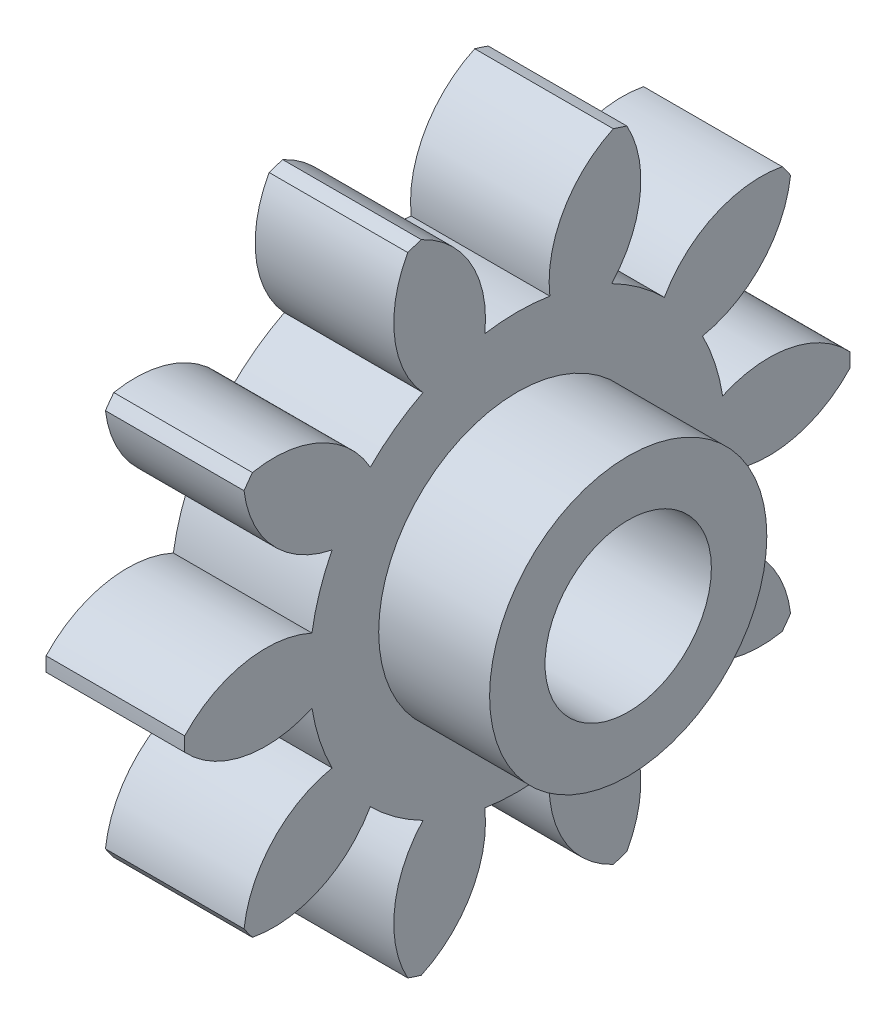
ISO-10303-21;
HEADER;
FILE_DESCRIPTION(('STEP AP214'),'2;1');
FILE_NAME('part.step','',(''),(''),'','','');
FILE_SCHEMA(('AUTOMOTIVE_DESIGN { 1 0 10303 214 1 1 1 1 }'));
ENDSEC;
DATA;
#1=APPLICATION_CONTEXT('core data for automotive mechanical design processes');
#2=APPLICATION_PROTOCOL_DEFINITION('international standard','automotive_design',2000,#1);
#3=PRODUCT_CONTEXT('',#1,'mechanical');
#4=PRODUCT('Part','Part','',(#3));
#5=PRODUCT_RELATED_PRODUCT_CATEGORY('part','',(#4));
#6=PRODUCT_DEFINITION_FORMATION('','',#4);
#7=PRODUCT_DEFINITION_CONTEXT('part definition',#1,'design');
#8=PRODUCT_DEFINITION('design','',#6,#7);
#9=PRODUCT_DEFINITION_SHAPE('','',#8);
#10=(LENGTH_UNIT() NAMED_UNIT(*) SI_UNIT(.MILLI.,.METRE.));
#11=(NAMED_UNIT(*) PLANE_ANGLE_UNIT() SI_UNIT($,.RADIAN.));
#12=(NAMED_UNIT(*) SI_UNIT($,.STERADIAN.) SOLID_ANGLE_UNIT());
#13=UNCERTAINTY_MEASURE_WITH_UNIT(LENGTH_MEASURE(1.E-05),#10,'distance_accuracy_value','');
#14=(GEOMETRIC_REPRESENTATION_CONTEXT(3) GLOBAL_UNCERTAINTY_ASSIGNED_CONTEXT((#13)) GLOBAL_UNIT_ASSIGNED_CONTEXT((#10,
#11,#12)) REPRESENTATION_CONTEXT('',''));
#15=CARTESIAN_POINT('',(0.,0.,0.));
#16=DIRECTION('',(0.,0.,1.));
#17=DIRECTION('',(1.,0.,0.));
#18=AXIS2_PLACEMENT_3D('',#15,#16,#17);
#19=CARTESIAN_POINT('',(5.,0.,0.));
#20=DIRECTION('',(-1.,0.,0.));
#21=DIRECTION('',(0.,0.,1.));
#22=AXIS2_PLACEMENT_3D('',#19,#20,#21);
#23=PLANE('',#22);
#24=CARTESIAN_POINT('',(5.,3.3343462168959,-8.78546284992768));
#25=DIRECTION('',(-1.,0.,0.));
#26=DIRECTION('',(0.,-0.587785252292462,-0.809016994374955));
#27=AXIS2_PLACEMENT_3D('',#24,#25,#26);
#28=CIRCLE('',#27,4.);
#29=CARTESIAN_POINT('',(5.,5.30219236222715,-5.30299511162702));
#30=VERTEX_POINT('',#29);
#31=CARTESIAN_POINT('',(5.,7.25962702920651,-9.55498903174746));
#32=VERTEX_POINT('',#31);
#33=EDGE_CURVE('E301',#30,#32,#28,.T.);
#34=ORIENTED_EDGE('',*,*,#33,.F.);
#35=CARTESIAN_POINT('',(5.,0.,0.));
#36=DIRECTION('',(-1.,0.,0.));
#37=DIRECTION('',(0.,-0.587785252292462,-0.809016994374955));
#38=AXIS2_PLACEMENT_3D('',#35,#36,#37);
#39=CIRCLE('',#38,7.499);
#40=CARTESIAN_POINT('',(5.,6.68191560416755,-3.40396898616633));
#41=VERTEX_POINT('',#40);
#42=EDGE_CURVE('E300',#41,#30,#39,.T.);
#43=ORIENTED_EDGE('',*,*,#42,.F.);
#44=CARTESIAN_POINT('',(5.,9.38584133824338,-0.456294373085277));
#45=DIRECTION('',(-1.,0.,0.));
#46=DIRECTION('',(0.,-0.587785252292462,-0.809016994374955));
#47=AXIS2_PLACEMENT_3D('',#44,#45,#46);
#48=CIRCLE('',#47,4.);
#49=CARTESIAN_POINT('',(5.,11.3306827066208,-3.9516616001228));
#50=VERTEX_POINT('',#49);
#51=EDGE_CURVE('E289',#50,#41,#48,.T.);
#52=ORIENTED_EDGE('',*,*,#51,.F.);
#53=CARTESIAN_POINT('',(5.,0.,0.));
#54=DIRECTION('',(-1.,0.,0.));
#55=DIRECTION('',(0.,0.,1.));
#56=AXIS2_PLACEMENT_3D('',#53,#54,#55);
#57=CIRCLE('',#56,12.);
#58=CARTESIAN_POINT('',(5.,11.4894432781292,-3.46304680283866));
#59=VERTEX_POINT('',#58);
#60=EDGE_CURVE('E524',#59,#50,#57,.T.);
#61=ORIENTED_EDGE('',*,*,#60,.F.);
#62=CARTESIAN_POINT('',(5.,7.86150825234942,-5.14770921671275));
#63=DIRECTION('',(-1.,0.,0.));
#64=DIRECTION('',(0.,0.,-1.));
#65=AXIS2_PLACEMENT_3D('',#62,#63,#64);
#66=CIRCLE('',#65,4.);
#67=CARTESIAN_POINT('',(5.,7.40658604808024,-1.17366269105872));
#68=VERTEX_POINT('',#67);
#69=EDGE_CURVE('E497',#68,#59,#66,.T.);
#70=ORIENTED_EDGE('',*,*,#69,.F.);
#71=CARTESIAN_POINT('',(5.,0.,0.));
#72=DIRECTION('',(-1.,0.,0.));
#73=DIRECTION('',(0.,0.,-1.));
#74=AXIS2_PLACEMENT_3D('',#71,#72,#73);
#75=CIRCLE('',#74,7.499);
#76=CARTESIAN_POINT('',(5.,7.40658604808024,1.17366269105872));
#77=VERTEX_POINT('',#76);
#78=EDGE_CURVE('E502',#77,#68,#75,.T.);
#79=ORIENTED_EDGE('',*,*,#78,.F.);
#80=CARTESIAN_POINT('',(5.,7.86150825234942,5.14770921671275));
#81=DIRECTION('',(-1.,0.,0.));
#82=DIRECTION('',(0.,0.,-1.));
#83=AXIS2_PLACEMENT_3D('',#80,#81,#82);
#84=CIRCLE('',#83,4.);
#85=CARTESIAN_POINT('',(5.,11.4894432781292,3.46304680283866));
#86=VERTEX_POINT('',#85);
#87=EDGE_CURVE('E499',#86,#77,#84,.T.);
#88=ORIENTED_EDGE('',*,*,#87,.F.);
#89=CARTESIAN_POINT('',(5.,11.3306827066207,3.95166160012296));
#90=VERTEX_POINT('',#89);
#91=EDGE_CURVE('E522',#90,#86,#57,.T.);
#92=ORIENTED_EDGE('',*,*,#91,.F.);
#93=CARTESIAN_POINT('',(5.,9.38584133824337,0.456294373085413));
#94=DIRECTION('',(-1.,0.,0.));
#95=DIRECTION('',(0.,0.587785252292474,-0.809016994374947));
#96=AXIS2_PLACEMENT_3D('',#93,#94,#95);
#97=CIRCLE('',#96,4.);
#98=CARTESIAN_POINT('',(5.,6.6819156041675,3.40396898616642));
#99=VERTEX_POINT('',#98);
#100=EDGE_CURVE('E475',#99,#90,#97,.T.);
#101=ORIENTED_EDGE('',*,*,#100,.F.);
#102=CARTESIAN_POINT('',(5.,0.,0.));
#103=DIRECTION('',(-1.,0.,0.));
#104=DIRECTION('',(0.,0.587785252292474,-0.809016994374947));
#105=AXIS2_PLACEMENT_3D('',#102,#103,#104);
#106=CIRCLE('',#105,7.499);
#107=CARTESIAN_POINT('',(5.,5.30219236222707,5.3029951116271));
#108=VERTEX_POINT('',#107);
#109=EDGE_CURVE('E480',#108,#99,#106,.T.);
#110=ORIENTED_EDGE('',*,*,#109,.F.);
#111=CARTESIAN_POINT('',(5.,3.33434621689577,8.78546284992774));
#112=DIRECTION('',(-1.,0.,0.));
#113=DIRECTION('',(0.,0.587785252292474,-0.809016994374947));
#114=AXIS2_PLACEMENT_3D('',#111,#112,#113);
#115=CIRCLE('',#114,4.);
#116=CARTESIAN_POINT('',(5.,7.25962702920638,9.55498903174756));
#117=VERTEX_POINT('',#116);
#118=EDGE_CURVE('E477',#117,#108,#115,.T.);
#119=ORIENTED_EDGE('',*,*,#118,.F.);
#120=CARTESIAN_POINT('',(5.,6.84398645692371,9.8569695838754));
#121=VERTEX_POINT('',#120);
#122=EDGE_CURVE('E599',#121,#117,#57,.T.);
#123=ORIENTED_EDGE('',*,*,#122,.F.);
#124=CARTESIAN_POINT('',(5.,7.32510204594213,5.88600902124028));
#125=DIRECTION('',(-1.,0.,0.));
#126=DIRECTION('',(0.,0.951056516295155,-0.309016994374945));
#127=AXIS2_PLACEMENT_3D('',#124,#125,#126);
#128=CIRCLE('',#127,4.);
#129=CARTESIAN_POINT('',(5.,3.40498050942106,6.68140020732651));
#130=VERTEX_POINT('',#129);
#131=EDGE_CURVE('E453',#130,#121,#128,.T.);
#132=ORIENTED_EDGE('',*,*,#131,.F.);
#133=CARTESIAN_POINT('',(5.,0.,0.));
#134=DIRECTION('',(-1.,0.,0.));
#135=DIRECTION('',(0.,0.951056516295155,-0.309016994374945));
#136=AXIS2_PLACEMENT_3D('',#133,#134,#135);
#137=CIRCLE('',#136,7.499);
#138=CARTESIAN_POINT('',(5.,1.17254140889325,7.40676364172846));
#139=VERTEX_POINT('',#138);
#140=EDGE_CURVE('E458',#139,#130,#137,.T.);
#141=ORIENTED_EDGE('',*,*,#140,.F.);
#142=CARTESIAN_POINT('',(5.,-2.46642274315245,9.06746828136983));
#143=DIRECTION('',(-1.,0.,0.));
#144=DIRECTION('',(0.,0.951056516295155,-0.309016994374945));
#145=AXIS2_PLACEMENT_3D('',#142,#143,#144);
#146=CIRCLE('',#145,4.);
#147=CARTESIAN_POINT('',(5.,0.256880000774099,11.9972502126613));
#148=VERTEX_POINT('',#147);
#149=EDGE_CURVE('E455',#148,#139,#146,.T.);
#150=ORIENTED_EDGE('',*,*,#149,.F.);
#151=CARTESIAN_POINT('',(5.,-0.256880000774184,11.9972502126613));
#152=VERTEX_POINT('',#151);
#153=EDGE_CURVE('E594',#152,#148,#57,.T.);
#154=ORIENTED_EDGE('',*,*,#153,.F.);
#155=CARTESIAN_POINT('',(5.,2.46642274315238,9.06746828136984));
#156=DIRECTION('',(-1.,0.,0.));
#157=DIRECTION('',(0.,0.951056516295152,0.309016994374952));
#158=AXIS2_PLACEMENT_3D('',#155,#156,#157);
#159=CIRCLE('',#158,4.);
#160=CARTESIAN_POINT('',(5.,-1.17254140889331,7.40676364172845));
#161=VERTEX_POINT('',#160);
#162=EDGE_CURVE('E431',#161,#152,#159,.T.);
#163=ORIENTED_EDGE('',*,*,#162,.F.);
#164=CARTESIAN_POINT('',(5.,0.,0.));
#165=DIRECTION('',(-1.,0.,0.));
#166=DIRECTION('',(0.,0.951056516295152,0.309016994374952));
#167=AXIS2_PLACEMENT_3D('',#164,#165,#166);
#168=CIRCLE('',#167,7.499);
#169=CARTESIAN_POINT('',(5.,-3.40498050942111,6.68140020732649));
#170=VERTEX_POINT('',#169);
#171=EDGE_CURVE('E436',#170,#161,#168,.T.);
#172=ORIENTED_EDGE('',*,*,#171,.F.);
#173=CARTESIAN_POINT('',(5.,-7.32510204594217,5.88600902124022));
#174=DIRECTION('',(-1.,0.,0.));
#175=DIRECTION('',(0.,0.951056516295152,0.309016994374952));
#176=AXIS2_PLACEMENT_3D('',#173,#174,#175);
#177=CIRCLE('',#176,4.);
#178=CARTESIAN_POINT('',(5.,-6.84398645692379,9.85696958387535));
#179=VERTEX_POINT('',#178);
#180=EDGE_CURVE('E433',#179,#170,#177,.T.);
#181=ORIENTED_EDGE('',*,*,#180,.F.);
#182=CARTESIAN_POINT('',(5.,-7.25962702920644,9.55498903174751));
#183=VERTEX_POINT('',#182);
#184=EDGE_CURVE('E589',#183,#179,#57,.T.);
#185=ORIENTED_EDGE('',*,*,#184,.F.);
#186=CARTESIAN_POINT('',(5.,-3.33434621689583,8.78546284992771));
#187=DIRECTION('',(-1.,0.,0.));
#188=DIRECTION('',(0.,0.587785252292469,0.809016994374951));
#189=AXIS2_PLACEMENT_3D('',#186,#187,#188);
#190=CIRCLE('',#189,4.);
#191=CARTESIAN_POINT('',(5.,-5.30219236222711,5.30299511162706));
#192=VERTEX_POINT('',#191);
#193=EDGE_CURVE('E409',#192,#183,#190,.T.);
#194=ORIENTED_EDGE('',*,*,#193,.F.);
#195=CARTESIAN_POINT('',(5.,0.,0.));
#196=DIRECTION('',(-1.,0.,0.));
#197=DIRECTION('',(0.,0.587785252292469,0.809016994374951));
#198=AXIS2_PLACEMENT_3D('',#195,#196,#197);
#199=CIRCLE('',#198,7.499);
#200=CARTESIAN_POINT('',(5.,-6.68191560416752,3.40396898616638));
#201=VERTEX_POINT('',#200);
#202=EDGE_CURVE('E414',#201,#192,#199,.T.);
#203=ORIENTED_EDGE('',*,*,#202,.F.);
#204=CARTESIAN_POINT('',(5.,-9.38584133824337,0.456294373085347));
#205=DIRECTION('',(-1.,0.,0.));
#206=DIRECTION('',(0.,0.587785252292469,0.809016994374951));
#207=AXIS2_PLACEMENT_3D('',#204,#205,#206);
#208=CIRCLE('',#207,4.);
#209=CARTESIAN_POINT('',(5.,-11.3306827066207,3.95166160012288));
#210=VERTEX_POINT('',#209);
#211=EDGE_CURVE('E411',#210,#201,#208,.T.);
#212=ORIENTED_EDGE('',*,*,#211,.F.);
#213=CARTESIAN_POINT('',(5.,-11.4894432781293,3.46304680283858));
#214=VERTEX_POINT('',#213);
#215=EDGE_CURVE('E584',#214,#210,#57,.T.);
#216=ORIENTED_EDGE('',*,*,#215,.F.);
#217=CARTESIAN_POINT('',(5.,-7.86150825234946,5.1477092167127));
#218=DIRECTION('',(-1.,0.,0.));
#219=DIRECTION('',(0.,0.,1.));
#220=AXIS2_PLACEMENT_3D('',#217,#218,#219);
#221=CIRCLE('',#220,4.);
#222=CARTESIAN_POINT('',(5.,-7.40658604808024,1.17366269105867));
#223=VERTEX_POINT('',#222);
#224=EDGE_CURVE('E387',#223,#214,#221,.T.);
#225=ORIENTED_EDGE('',*,*,#224,.F.);
#226=CARTESIAN_POINT('',(5.,0.,0.));
#227=DIRECTION('',(-1.,0.,0.));
#228=DIRECTION('',(0.,0.,1.));
#229=AXIS2_PLACEMENT_3D('',#226,#227,#228);
#230=CIRCLE('',#229,7.499);
#231=CARTESIAN_POINT('',(5.,-7.40658604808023,-1.17366269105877));
#232=VERTEX_POINT('',#231);
#233=EDGE_CURVE('E392',#232,#223,#230,.T.);
#234=ORIENTED_EDGE('',*,*,#233,.F.);
#235=CARTESIAN_POINT('',(5.,-7.86150825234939,-5.14770921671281));
#236=DIRECTION('',(-1.,0.,0.));
#237=DIRECTION('',(0.,0.,1.));
#238=AXIS2_PLACEMENT_3D('',#235,#236,#237);
#239=CIRCLE('',#238,4.);
#240=CARTESIAN_POINT('',(5.,-11.4894432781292,-3.46304680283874));
#241=VERTEX_POINT('',#240);
#242=EDGE_CURVE('E389',#241,#232,#239,.T.);
#243=ORIENTED_EDGE('',*,*,#242,.F.);
#244=CARTESIAN_POINT('',(5.,-11.3306827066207,-3.95166160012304));
#245=VERTEX_POINT('',#244);
#246=EDGE_CURVE('E579',#245,#241,#57,.T.);
#247=ORIENTED_EDGE('',*,*,#246,.F.);
#248=CARTESIAN_POINT('',(5.,-9.38584133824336,-0.456294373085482));
#249=DIRECTION('',(-1.,0.,0.));
#250=DIRECTION('',(0.,-0.58778525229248,0.809016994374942));
#251=AXIS2_PLACEMENT_3D('',#248,#249,#250);
#252=CIRCLE('',#251,4.);
#253=CARTESIAN_POINT('',(5.,-6.68191560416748,-3.40396898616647));
#254=VERTEX_POINT('',#253);
#255=EDGE_CURVE('E365',#254,#245,#252,.T.);
#256=ORIENTED_EDGE('',*,*,#255,.F.);
#257=CARTESIAN_POINT('',(5.,0.,0.));
#258=DIRECTION('',(-1.,0.,0.));
#259=DIRECTION('',(0.,-0.58778525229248,0.809016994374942));
#260=AXIS2_PLACEMENT_3D('',#257,#258,#259);
#261=CIRCLE('',#260,7.499);
#262=CARTESIAN_POINT('',(5.,-5.30219236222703,-5.30299511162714));
#263=VERTEX_POINT('',#262);
#264=EDGE_CURVE('E370',#263,#254,#261,.T.);
#265=ORIENTED_EDGE('',*,*,#264,.F.);
#266=CARTESIAN_POINT('',(5.,-3.3343462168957,-8.78546284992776));
#267=DIRECTION('',(-1.,0.,0.));
#268=DIRECTION('',(0.,-0.58778525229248,0.809016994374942));
#269=AXIS2_PLACEMENT_3D('',#266,#267,#268);
#270=CIRCLE('',#269,4.);
#271=CARTESIAN_POINT('',(5.,-7.2596270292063,-9.55498903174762));
#272=VERTEX_POINT('',#271);
#273=EDGE_CURVE('E367',#272,#263,#270,.T.);
#274=ORIENTED_EDGE('',*,*,#273,.F.);
#275=CARTESIAN_POINT('',(5.,-6.84398645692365,-9.85696958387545));
#276=VERTEX_POINT('',#275);
#277=EDGE_CURVE('E574',#276,#272,#57,.T.);
#278=ORIENTED_EDGE('',*,*,#277,.F.);
#279=CARTESIAN_POINT('',(5.,-7.32510204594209,-5.88600902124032));
#280=DIRECTION('',(-1.,0.,0.));
#281=DIRECTION('',(0.,-0.951056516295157,0.309016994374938));
#282=AXIS2_PLACEMENT_3D('',#279,#280,#281);
#283=CIRCLE('',#282,4.);
#284=CARTESIAN_POINT('',(5.,-3.40498050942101,-6.68140020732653));
#285=VERTEX_POINT('',#284);
#286=EDGE_CURVE('E343',#285,#276,#283,.T.);
#287=ORIENTED_EDGE('',*,*,#286,.F.);
#288=CARTESIAN_POINT('',(5.,0.,0.));
#289=DIRECTION('',(-1.,0.,0.));
#290=DIRECTION('',(0.,-0.951056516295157,0.309016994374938));
#291=AXIS2_PLACEMENT_3D('',#288,#289,#290);
#292=CIRCLE('',#291,7.499);
#293=CARTESIAN_POINT('',(5.,-1.1725414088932,-7.40676364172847));
#294=VERTEX_POINT('',#293);
#295=EDGE_CURVE('E348',#294,#285,#292,.T.);
#296=ORIENTED_EDGE('',*,*,#295,.F.);
#297=CARTESIAN_POINT('',(5.,2.46642274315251,-9.06746828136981));
#298=DIRECTION('',(-1.,0.,0.));
#299=DIRECTION('',(0.,-0.951056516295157,0.309016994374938));
#300=AXIS2_PLACEMENT_3D('',#297,#298,#299);
#301=CIRCLE('',#300,4.);
#302=CARTESIAN_POINT('',(5.,-0.256880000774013,-11.9972502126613));
#303=VERTEX_POINT('',#302);
#304=EDGE_CURVE('E345',#303,#294,#301,.T.);
#305=ORIENTED_EDGE('',*,*,#304,.F.);
#306=CARTESIAN_POINT('',(5.,0.256880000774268,-11.9972502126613));
#307=VERTEX_POINT('',#306);
#308=EDGE_CURVE('E573',#307,#303,#57,.T.);
#309=ORIENTED_EDGE('',*,*,#308,.F.);
#310=CARTESIAN_POINT('',(5.,-2.46642274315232,-9.06746828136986));
#311=DIRECTION('',(-1.,0.,0.));
#312=DIRECTION('',(0.,-0.95105651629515,-0.309016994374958));
#313=AXIS2_PLACEMENT_3D('',#310,#311,#312);
#314=CIRCLE('',#313,4.);
#315=CARTESIAN_POINT('',(5.,1.17254140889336,-7.40676364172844));
#316=VERTEX_POINT('',#315);
#317=EDGE_CURVE('E323',#316,#307,#314,.T.);
#318=ORIENTED_EDGE('',*,*,#317,.F.);
#319=CARTESIAN_POINT('',(5.,0.,0.));
#320=DIRECTION('',(-1.,0.,0.));
#321=DIRECTION('',(0.,-0.95105651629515,-0.309016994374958));
#322=AXIS2_PLACEMENT_3D('',#319,#320,#321);
#323=CIRCLE('',#322,7.499);
#324=CARTESIAN_POINT('',(5.,3.40498050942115,-6.68140020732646));
#325=VERTEX_POINT('',#324);
#326=EDGE_CURVE('E328',#325,#316,#323,.T.);
#327=ORIENTED_EDGE('',*,*,#326,.F.);
#328=CARTESIAN_POINT('',(5.,7.32510204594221,-5.88600902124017));
#329=DIRECTION('',(-1.,0.,0.));
#330=DIRECTION('',(0.,-0.95105651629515,-0.309016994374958));
#331=AXIS2_PLACEMENT_3D('',#328,#329,#330);
#332=CIRCLE('',#331,4.);
#333=CARTESIAN_POINT('',(5.,6.84398645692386,-9.8569695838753));
#334=VERTEX_POINT('',#333);
#335=EDGE_CURVE('E325',#334,#325,#332,.T.);
#336=ORIENTED_EDGE('',*,*,#335,.F.);
#337=EDGE_CURVE('E527',#32,#334,#57,.T.);
#338=ORIENTED_EDGE('',*,*,#337,.F.);
#339=EDGE_LOOP('',(#34,#43,#52,#61,#70,#79,#88,#92,#101,#110,#119,#123,#132,#141,#150,#154,#163,
#172,#181,#185,#194,#203,#212,#216,#225,#234,#243,#247,#256,#265,#274,#278,#287,#296,#305,#309,
#318,#327,#336,#338));
#340=FACE_BOUND('',#339,.T.);
#341=CARTESIAN_POINT('',(5.,0.,0.));
#342=DIRECTION('',(-1.,0.,0.));
#343=DIRECTION('',(0.,0.,1.));
#344=AXIS2_PLACEMENT_3D('',#341,#342,#343);
#345=CIRCLE('',#344,5.);
#346=CARTESIAN_POINT('',(5.,0.,5.));
#347=VERTEX_POINT('',#346);
#348=EDGE_CURVE('E11',#347,#347,#345,.F.);
#349=ORIENTED_EDGE('',*,*,#348,.F.);
#350=EDGE_LOOP('',(#349));
#351=FACE_BOUND('',#350,.T.);
#352=ADVANCED_FACE('F32',(#340,#351),#23,.F.);
#353=CARTESIAN_POINT('',(0.,0.,0.));
#354=DIRECTION('',(1.,0.,0.));
#355=DIRECTION('',(0.,0.,-1.));
#356=AXIS2_PLACEMENT_3D('',#353,#354,#355);
#357=PLANE('',#356);
#358=CARTESIAN_POINT('',(0.,3.3343462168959,-8.78546284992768));
#359=DIRECTION('',(-1.,0.,0.));
#360=DIRECTION('',(0.,-0.587785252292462,-0.809016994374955));
#361=AXIS2_PLACEMENT_3D('',#358,#359,#360);
#362=CIRCLE('',#361,4.);
#363=CARTESIAN_POINT('',(0.,5.30219236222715,-5.30299511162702));
#364=VERTEX_POINT('',#363);
#365=CARTESIAN_POINT('',(0.,7.25962702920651,-9.55498903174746));
#366=VERTEX_POINT('',#365);
#367=EDGE_CURVE('E46',#364,#366,#362,.T.);
#368=ORIENTED_EDGE('',*,*,#367,.T.);
#369=CARTESIAN_POINT('',(0.,0.,0.));
#370=DIRECTION('',(-1.,0.,0.));
#371=DIRECTION('',(0.,0.,1.));
#372=AXIS2_PLACEMENT_3D('',#369,#370,#371);
#373=CIRCLE('',#372,12.);
#374=CARTESIAN_POINT('',(0.,6.84398645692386,-9.8569695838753));
#375=VERTEX_POINT('',#374);
#376=EDGE_CURVE('E523',#366,#375,#373,.T.);
#377=ORIENTED_EDGE('',*,*,#376,.T.);
#378=CARTESIAN_POINT('',(0.,7.32510204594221,-5.88600902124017));
#379=DIRECTION('',(1.,0.,0.));
#380=DIRECTION('',(0.,0.,-1.));
#381=AXIS2_PLACEMENT_3D('',#378,#379,#380);
#382=CIRCLE('',#381,4.);
#383=CARTESIAN_POINT('',(0.,3.40498050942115,-6.68140020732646));
#384=VERTEX_POINT('',#383);
#385=EDGE_CURVE('E551',#384,#375,#382,.T.);
#386=ORIENTED_EDGE('',*,*,#385,.F.);
#387=CARTESIAN_POINT('',(0.,0.,0.));
#388=DIRECTION('',(-1.,0.,0.));
#389=DIRECTION('',(0.,-0.95105651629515,-0.309016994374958));
#390=AXIS2_PLACEMENT_3D('',#387,#388,#389);
#391=CIRCLE('',#390,7.499);
#392=CARTESIAN_POINT('',(0.,1.17254140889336,-7.40676364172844));
#393=VERTEX_POINT('',#392);
#394=EDGE_CURVE('E326',#384,#393,#391,.T.);
#395=ORIENTED_EDGE('',*,*,#394,.T.);
#396=CARTESIAN_POINT('',(0.,-2.46642274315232,-9.06746828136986));
#397=DIRECTION('',(-1.,0.,0.));
#398=DIRECTION('',(0.,-0.95105651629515,-0.309016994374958));
#399=AXIS2_PLACEMENT_3D('',#396,#397,#398);
#400=CIRCLE('',#399,4.);
#401=CARTESIAN_POINT('',(0.,0.256880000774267,-11.9972502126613));
#402=VERTEX_POINT('',#401);
#403=EDGE_CURVE('E54',#393,#402,#400,.T.);
#404=ORIENTED_EDGE('',*,*,#403,.T.);
#405=CARTESIAN_POINT('',(0.,-0.256880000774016,-11.9972502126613));
#406=VERTEX_POINT('',#405);
#407=EDGE_CURVE('E1059',#402,#406,#373,.T.);
#408=ORIENTED_EDGE('',*,*,#407,.T.);
#409=CARTESIAN_POINT('',(0.,2.46642274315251,-9.06746828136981));
#410=DIRECTION('',(1.,0.,0.));
#411=DIRECTION('',(0.,0.,-1.));
#412=AXIS2_PLACEMENT_3D('',#409,#410,#411);
#413=CIRCLE('',#412,4.);
#414=CARTESIAN_POINT('',(0.,-1.1725414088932,-7.40676364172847));
#415=VERTEX_POINT('',#414);
#416=EDGE_CURVE('E548',#415,#406,#413,.T.);
#417=ORIENTED_EDGE('',*,*,#416,.F.);
#418=CARTESIAN_POINT('',(0.,0.,0.));
#419=DIRECTION('',(-1.,0.,0.));
#420=DIRECTION('',(0.,-0.951056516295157,0.309016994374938));
#421=AXIS2_PLACEMENT_3D('',#418,#419,#420);
#422=CIRCLE('',#421,7.499);
#423=CARTESIAN_POINT('',(0.,-3.40498050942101,-6.68140020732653));
#424=VERTEX_POINT('',#423);
#425=EDGE_CURVE('E346',#415,#424,#422,.T.);
#426=ORIENTED_EDGE('',*,*,#425,.T.);
#427=CARTESIAN_POINT('',(0.,-7.32510204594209,-5.88600902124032));
#428=DIRECTION('',(-1.,0.,0.));
#429=DIRECTION('',(0.,-0.951056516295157,0.309016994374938));
#430=AXIS2_PLACEMENT_3D('',#427,#428,#429);
#431=CIRCLE('',#430,4.);
#432=CARTESIAN_POINT('',(0.,-6.84398645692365,-9.85696958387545));
#433=VERTEX_POINT('',#432);
#434=EDGE_CURVE('E342',#424,#433,#431,.T.);
#435=ORIENTED_EDGE('',*,*,#434,.T.);
#436=CARTESIAN_POINT('',(0.,-7.2596270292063,-9.55498903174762));
#437=VERTEX_POINT('',#436);
#438=EDGE_CURVE('E1049',#433,#437,#373,.T.);
#439=ORIENTED_EDGE('',*,*,#438,.T.);
#440=CARTESIAN_POINT('',(0.,-3.3343462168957,-8.78546284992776));
#441=DIRECTION('',(1.,0.,0.));
#442=DIRECTION('',(0.,0.,-1.));
#443=AXIS2_PLACEMENT_3D('',#440,#441,#442);
#444=CIRCLE('',#443,4.);
#445=CARTESIAN_POINT('',(0.,-5.30219236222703,-5.30299511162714));
#446=VERTEX_POINT('',#445);
#447=EDGE_CURVE('E545',#446,#437,#444,.T.);
#448=ORIENTED_EDGE('',*,*,#447,.F.);
#449=CARTESIAN_POINT('',(0.,0.,0.));
#450=DIRECTION('',(-1.,0.,0.));
#451=DIRECTION('',(0.,-0.58778525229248,0.809016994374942));
#452=AXIS2_PLACEMENT_3D('',#449,#450,#451);
#453=CIRCLE('',#452,7.499);
#454=CARTESIAN_POINT('',(0.,-6.68191560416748,-3.40396898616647));
#455=VERTEX_POINT('',#454);
#456=EDGE_CURVE('E368',#446,#455,#453,.T.);
#457=ORIENTED_EDGE('',*,*,#456,.T.);
#458=CARTESIAN_POINT('',(0.,-9.38584133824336,-0.456294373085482));
#459=DIRECTION('',(-1.,0.,0.));
#460=DIRECTION('',(0.,-0.58778525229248,0.809016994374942));
#461=AXIS2_PLACEMENT_3D('',#458,#459,#460);
#462=CIRCLE('',#461,4.);
#463=CARTESIAN_POINT('',(0.,-11.3306827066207,-3.95166160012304));
#464=VERTEX_POINT('',#463);
#465=EDGE_CURVE('E364',#455,#464,#462,.T.);
#466=ORIENTED_EDGE('',*,*,#465,.T.);
#467=CARTESIAN_POINT('',(0.,-11.4894432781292,-3.46304680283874));
#468=VERTEX_POINT('',#467);
#469=EDGE_CURVE('E1060',#464,#468,#373,.T.);
#470=ORIENTED_EDGE('',*,*,#469,.T.);
#471=CARTESIAN_POINT('',(0.,-7.86150825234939,-5.14770921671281));
#472=DIRECTION('',(1.,0.,0.));
#473=DIRECTION('',(0.,0.,-1.));
#474=AXIS2_PLACEMENT_3D('',#471,#472,#473);
#475=CIRCLE('',#474,4.);
#476=CARTESIAN_POINT('',(0.,-7.40658604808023,-1.17366269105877));
#477=VERTEX_POINT('',#476);
#478=EDGE_CURVE('E542',#477,#468,#475,.T.);
#479=ORIENTED_EDGE('',*,*,#478,.F.);
#480=CARTESIAN_POINT('',(0.,0.,0.));
#481=DIRECTION('',(-1.,0.,0.));
#482=DIRECTION('',(0.,0.,1.));
#483=AXIS2_PLACEMENT_3D('',#480,#481,#482);
#484=CIRCLE('',#483,7.499);
#485=CARTESIAN_POINT('',(0.,-7.40658604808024,1.17366269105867));
#486=VERTEX_POINT('',#485);
#487=EDGE_CURVE('E390',#477,#486,#484,.T.);
#488=ORIENTED_EDGE('',*,*,#487,.T.);
#489=CARTESIAN_POINT('',(0.,-7.86150825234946,5.1477092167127));
#490=DIRECTION('',(-1.,0.,0.));
#491=DIRECTION('',(0.,0.,1.));
#492=AXIS2_PLACEMENT_3D('',#489,#490,#491);
#493=CIRCLE('',#492,4.);
#494=CARTESIAN_POINT('',(0.,-11.4894432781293,3.46304680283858));
#495=VERTEX_POINT('',#494);
#496=EDGE_CURVE('E386',#486,#495,#493,.T.);
#497=ORIENTED_EDGE('',*,*,#496,.T.);
#498=CARTESIAN_POINT('',(0.,-11.3306827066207,3.95166160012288));
#499=VERTEX_POINT('',#498);
#500=EDGE_CURVE('E1061',#495,#499,#373,.T.);
#501=ORIENTED_EDGE('',*,*,#500,.T.);
#502=CARTESIAN_POINT('',(0.,-9.38584133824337,0.456294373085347));
#503=DIRECTION('',(1.,0.,0.));
#504=DIRECTION('',(0.,0.,-1.));
#505=AXIS2_PLACEMENT_3D('',#502,#503,#504);
#506=CIRCLE('',#505,4.);
#507=CARTESIAN_POINT('',(0.,-6.68191560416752,3.40396898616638));
#508=VERTEX_POINT('',#507);
#509=EDGE_CURVE('E539',#508,#499,#506,.T.);
#510=ORIENTED_EDGE('',*,*,#509,.F.);
#511=CARTESIAN_POINT('',(0.,0.,0.));
#512=DIRECTION('',(-1.,0.,0.));
#513=DIRECTION('',(0.,0.587785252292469,0.809016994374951));
#514=AXIS2_PLACEMENT_3D('',#511,#512,#513);
#515=CIRCLE('',#514,7.499);
#516=CARTESIAN_POINT('',(0.,-5.30219236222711,5.30299511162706));
#517=VERTEX_POINT('',#516);
#518=EDGE_CURVE('E412',#508,#517,#515,.T.);
#519=ORIENTED_EDGE('',*,*,#518,.T.);
#520=CARTESIAN_POINT('',(0.,-3.33434621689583,8.78546284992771));
#521=DIRECTION('',(-1.,0.,0.));
#522=DIRECTION('',(0.,0.587785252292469,0.809016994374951));
#523=AXIS2_PLACEMENT_3D('',#520,#521,#522);
#524=CIRCLE('',#523,4.);
#525=CARTESIAN_POINT('',(0.,-7.25962702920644,9.55498903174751));
#526=VERTEX_POINT('',#525);
#527=EDGE_CURVE('E408',#517,#526,#524,.T.);
#528=ORIENTED_EDGE('',*,*,#527,.T.);
#529=CARTESIAN_POINT('',(0.,-6.84398645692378,9.85696958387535));
#530=VERTEX_POINT('',#529);
#531=EDGE_CURVE('E1064',#526,#530,#373,.T.);
#532=ORIENTED_EDGE('',*,*,#531,.T.);
#533=CARTESIAN_POINT('',(0.,-7.32510204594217,5.88600902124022));
#534=DIRECTION('',(1.,0.,0.));
#535=DIRECTION('',(0.,0.,-1.));
#536=AXIS2_PLACEMENT_3D('',#533,#534,#535);
#537=CIRCLE('',#536,4.);
#538=CARTESIAN_POINT('',(0.,-3.40498050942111,6.68140020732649));
#539=VERTEX_POINT('',#538);
#540=EDGE_CURVE('E536',#539,#530,#537,.T.);
#541=ORIENTED_EDGE('',*,*,#540,.F.);
#542=CARTESIAN_POINT('',(0.,0.,0.));
#543=DIRECTION('',(-1.,0.,0.));
#544=DIRECTION('',(0.,0.951056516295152,0.309016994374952));
#545=AXIS2_PLACEMENT_3D('',#542,#543,#544);
#546=CIRCLE('',#545,7.499);
#547=CARTESIAN_POINT('',(0.,-1.1725414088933,7.40676364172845));
#548=VERTEX_POINT('',#547);
#549=EDGE_CURVE('E434',#539,#548,#546,.T.);
#550=ORIENTED_EDGE('',*,*,#549,.T.);
#551=CARTESIAN_POINT('',(0.,2.46642274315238,9.06746828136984));
#552=DIRECTION('',(-1.,0.,0.));
#553=DIRECTION('',(0.,0.951056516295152,0.309016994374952));
#554=AXIS2_PLACEMENT_3D('',#551,#552,#553);
#555=CIRCLE('',#554,4.);
#556=CARTESIAN_POINT('',(0.,-0.256880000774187,11.9972502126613));
#557=VERTEX_POINT('',#556);
#558=EDGE_CURVE('E430',#548,#557,#555,.T.);
#559=ORIENTED_EDGE('',*,*,#558,.T.);
#560=CARTESIAN_POINT('',(0.,0.256880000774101,11.9972502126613));
#561=VERTEX_POINT('',#560);
#562=EDGE_CURVE('E1067',#557,#561,#373,.T.);
#563=ORIENTED_EDGE('',*,*,#562,.T.);
#564=CARTESIAN_POINT('',(0.,-2.46642274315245,9.06746828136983));
#565=DIRECTION('',(1.,0.,0.));
#566=DIRECTION('',(0.,0.,-1.));
#567=AXIS2_PLACEMENT_3D('',#564,#565,#566);
#568=CIRCLE('',#567,4.);
#569=CARTESIAN_POINT('',(0.,1.17254140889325,7.40676364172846));
#570=VERTEX_POINT('',#569);
#571=EDGE_CURVE('E533',#570,#561,#568,.T.);
#572=ORIENTED_EDGE('',*,*,#571,.F.);
#573=CARTESIAN_POINT('',(0.,0.,0.));
#574=DIRECTION('',(-1.,0.,0.));
#575=DIRECTION('',(0.,0.951056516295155,-0.309016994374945));
#576=AXIS2_PLACEMENT_3D('',#573,#574,#575);
#577=CIRCLE('',#576,7.499);
#578=CARTESIAN_POINT('',(0.,3.40498050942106,6.68140020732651));
#579=VERTEX_POINT('',#578);
#580=EDGE_CURVE('E456',#570,#579,#577,.T.);
#581=ORIENTED_EDGE('',*,*,#580,.T.);
#582=CARTESIAN_POINT('',(0.,7.32510204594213,5.88600902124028));
#583=DIRECTION('',(-1.,0.,0.));
#584=DIRECTION('',(0.,0.951056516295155,-0.309016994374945));
#585=AXIS2_PLACEMENT_3D('',#582,#583,#584);
#586=CIRCLE('',#585,4.);
#587=CARTESIAN_POINT('',(0.,6.84398645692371,9.8569695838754));
#588=VERTEX_POINT('',#587);
#589=EDGE_CURVE('E452',#579,#588,#586,.T.);
#590=ORIENTED_EDGE('',*,*,#589,.T.);
#591=CARTESIAN_POINT('',(0.,7.25962702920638,9.55498903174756));
#592=VERTEX_POINT('',#591);
#593=EDGE_CURVE('E1070',#588,#592,#373,.T.);
#594=ORIENTED_EDGE('',*,*,#593,.T.);
#595=CARTESIAN_POINT('',(0.,3.33434621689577,8.78546284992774));
#596=DIRECTION('',(1.,0.,0.));
#597=DIRECTION('',(0.,0.,-1.));
#598=AXIS2_PLACEMENT_3D('',#595,#596,#597);
#599=CIRCLE('',#598,4.);
#600=CARTESIAN_POINT('',(0.,5.30219236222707,5.3029951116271));
#601=VERTEX_POINT('',#600);
#602=EDGE_CURVE('E530',#601,#592,#599,.T.);
#603=ORIENTED_EDGE('',*,*,#602,.F.);
#604=CARTESIAN_POINT('',(0.,0.,0.));
#605=DIRECTION('',(-1.,0.,0.));
#606=DIRECTION('',(0.,0.587785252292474,-0.809016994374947));
#607=AXIS2_PLACEMENT_3D('',#604,#605,#606);
#608=CIRCLE('',#607,7.499);
#609=CARTESIAN_POINT('',(0.,6.6819156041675,3.40396898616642));
#610=VERTEX_POINT('',#609);
#611=EDGE_CURVE('E478',#601,#610,#608,.T.);
#612=ORIENTED_EDGE('',*,*,#611,.T.);
#613=CARTESIAN_POINT('',(0.,9.38584133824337,0.456294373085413));
#614=DIRECTION('',(-1.,0.,0.));
#615=DIRECTION('',(0.,0.587785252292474,-0.809016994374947));
#616=AXIS2_PLACEMENT_3D('',#613,#614,#615);
#617=CIRCLE('',#616,4.);
#618=CARTESIAN_POINT('',(0.,11.3306827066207,3.95166160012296));
#619=VERTEX_POINT('',#618);
#620=EDGE_CURVE('E474',#610,#619,#617,.T.);
#621=ORIENTED_EDGE('',*,*,#620,.T.);
#622=CARTESIAN_POINT('',(0.,11.4894432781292,3.46304680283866));
#623=VERTEX_POINT('',#622);
#624=EDGE_CURVE('E518',#619,#623,#373,.T.);
#625=ORIENTED_EDGE('',*,*,#624,.T.);
#626=CARTESIAN_POINT('',(0.,7.86150825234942,5.14770921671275));
#627=DIRECTION('',(1.,0.,0.));
#628=DIRECTION('',(0.,0.,-1.));
#629=AXIS2_PLACEMENT_3D('',#626,#627,#628);
#630=CIRCLE('',#629,4.);
#631=CARTESIAN_POINT('',(0.,7.40658604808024,1.17366269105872));
#632=VERTEX_POINT('',#631);
#633=EDGE_CURVE('E526',#632,#623,#630,.T.);
#634=ORIENTED_EDGE('',*,*,#633,.F.);
#635=CARTESIAN_POINT('',(0.,0.,0.));
#636=DIRECTION('',(-1.,0.,0.));
#637=DIRECTION('',(0.,0.,-1.));
#638=AXIS2_PLACEMENT_3D('',#635,#636,#637);
#639=CIRCLE('',#638,7.499);
#640=CARTESIAN_POINT('',(0.,7.40658604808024,-1.17366269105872));
#641=VERTEX_POINT('',#640);
#642=EDGE_CURVE('E500',#632,#641,#639,.T.);
#643=ORIENTED_EDGE('',*,*,#642,.T.);
#644=CARTESIAN_POINT('',(0.,7.86150825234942,-5.14770921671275));
#645=DIRECTION('',(-1.,0.,0.));
#646=DIRECTION('',(0.,0.,-1.));
#647=AXIS2_PLACEMENT_3D('',#644,#645,#646);
#648=CIRCLE('',#647,4.);
#649=CARTESIAN_POINT('',(0.,11.4894432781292,-3.46304680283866));
#650=VERTEX_POINT('',#649);
#651=EDGE_CURVE('E496',#641,#650,#648,.T.);
#652=ORIENTED_EDGE('',*,*,#651,.T.);
#653=CARTESIAN_POINT('',(0.,11.3306827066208,-3.95166160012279));
#654=VERTEX_POINT('',#653);
#655=EDGE_CURVE('E519',#650,#654,#373,.T.);
#656=ORIENTED_EDGE('',*,*,#655,.T.);
#657=CARTESIAN_POINT('',(0.,9.38584133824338,-0.456294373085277));
#658=DIRECTION('',(1.,0.,0.));
#659=DIRECTION('',(0.,0.,-1.));
#660=AXIS2_PLACEMENT_3D('',#657,#658,#659);
#661=CIRCLE('',#660,4.);
#662=CARTESIAN_POINT('',(0.,6.68191560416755,-3.40396898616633));
#663=VERTEX_POINT('',#662);
#664=EDGE_CURVE('E39',#663,#654,#661,.T.);
#665=ORIENTED_EDGE('',*,*,#664,.F.);
#666=CARTESIAN_POINT('',(0.,0.,0.));
#667=DIRECTION('',(-1.,0.,0.));
#668=DIRECTION('',(0.,-0.587785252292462,-0.809016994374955));
#669=AXIS2_PLACEMENT_3D('',#666,#667,#668);
#670=CIRCLE('',#669,7.499);
#671=EDGE_CURVE('E306',#663,#364,#670,.T.);
#672=ORIENTED_EDGE('',*,*,#671,.T.);
#673=EDGE_LOOP('',(#368,#377,#386,#395,#404,#408,#417,#426,#435,#439,#448,#457,#466,#470,#479,
#488,#497,#501,#510,#519,#528,#532,#541,#550,#559,#563,#572,#581,#590,#594,#603,#612,#621,#625,
#634,#643,#652,#656,#665,#672));
#674=FACE_BOUND('',#673,.T.);
#675=CARTESIAN_POINT('',(0.,0.,0.));
#676=DIRECTION('',(1.,0.,0.));
#677=DIRECTION('',(0.,0.,-1.));
#678=AXIS2_PLACEMENT_3D('',#675,#676,#677);
#679=CIRCLE('',#678,3.);
#680=CARTESIAN_POINT('',(0.,0.,-3.));
#681=VERTEX_POINT('',#680);
#682=EDGE_CURVE('E318',#681,#681,#679,.F.);
#683=ORIENTED_EDGE('',*,*,#682,.F.);
#684=EDGE_LOOP('',(#683));
#685=FACE_BOUND('',#684,.T.);
#686=ADVANCED_FACE('F631',(#674,#685),#357,.F.);
#687=CARTESIAN_POINT('',(-10.,0.,0.));
#688=DIRECTION('',(-1.,0.,0.));
#689=DIRECTION('',(0.,0.,1.));
#690=AXIS2_PLACEMENT_3D('',#687,#688,#689);
#691=CYLINDRICAL_SURFACE('',#690,12.);
#692=DIRECTION('',(-1.,0.,0.));
#693=VECTOR('',#692,1.);
#694=CARTESIAN_POINT('',(2.5,7.25962702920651,-9.55498903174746));
#695=LINE('',#694,#693);
#696=EDGE_CURVE('E321',#32,#366,#695,.T.);
#697=ORIENTED_EDGE('',*,*,#696,.F.);
#698=ORIENTED_EDGE('',*,*,#337,.T.);
#699=DIRECTION('',(-1.,0.,0.));
#700=VECTOR('',#699,1.);
#701=CARTESIAN_POINT('',(2.5,6.84398645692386,-9.8569695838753));
#702=LINE('',#701,#700);
#703=EDGE_CURVE('E337',#375,#334,#702,.F.);
#704=ORIENTED_EDGE('',*,*,#703,.F.);
#705=ORIENTED_EDGE('',*,*,#376,.F.);
#706=EDGE_LOOP('',(#697,#698,#704,#705));
#707=FACE_BOUND('',#706,.T.);
#708=ADVANCED_FACE('F569',(#707),#691,.T.);
#709=DIRECTION('',(-1.,0.,0.));
#710=VECTOR('',#709,1.);
#711=CARTESIAN_POINT('',(2.5,11.3306827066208,-3.95166160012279));
#712=LINE('',#711,#710);
#713=EDGE_CURVE('E295',#654,#50,#712,.F.);
#714=ORIENTED_EDGE('',*,*,#713,.F.);
#715=ORIENTED_EDGE('',*,*,#655,.F.);
#716=DIRECTION('',(-1.,0.,0.));
#717=VECTOR('',#716,1.);
#718=CARTESIAN_POINT('',(2.5,11.4894432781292,-3.46304680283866));
#719=LINE('',#718,#717);
#720=EDGE_CURVE('E516',#59,#650,#719,.T.);
#721=ORIENTED_EDGE('',*,*,#720,.F.);
#722=ORIENTED_EDGE('',*,*,#60,.T.);
#723=EDGE_LOOP('',(#714,#715,#721,#722));
#724=FACE_BOUND('',#723,.T.);
#725=ADVANCED_FACE('F634',(#724),#691,.T.);
#726=DIRECTION('',(-1.,0.,0.));
#727=VECTOR('',#726,1.);
#728=CARTESIAN_POINT('',(2.5,0.256880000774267,-11.9972502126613));
#729=LINE('',#728,#727);
#730=EDGE_CURVE('E340',#307,#402,#729,.T.);
#731=ORIENTED_EDGE('',*,*,#730,.F.);
#732=ORIENTED_EDGE('',*,*,#308,.T.);
#733=DIRECTION('',(-1.,0.,0.));
#734=VECTOR('',#733,1.);
#735=CARTESIAN_POINT('',(2.5,-0.256880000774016,-11.9972502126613));
#736=LINE('',#735,#734);
#737=EDGE_CURVE('E359',#406,#303,#736,.F.);
#738=ORIENTED_EDGE('',*,*,#737,.F.);
#739=ORIENTED_EDGE('',*,*,#407,.F.);
#740=EDGE_LOOP('',(#731,#732,#738,#739));
#741=FACE_BOUND('',#740,.T.);
#742=ADVANCED_FACE('F636',(#741),#691,.T.);
#743=DIRECTION('',(-1.,0.,0.));
#744=VECTOR('',#743,1.);
#745=CARTESIAN_POINT('',(2.5,-6.84398645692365,-9.85696958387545));
#746=LINE('',#745,#744);
#747=EDGE_CURVE('E362',#276,#433,#746,.T.);
#748=ORIENTED_EDGE('',*,*,#747,.F.);
#749=ORIENTED_EDGE('',*,*,#277,.T.);
#750=DIRECTION('',(-1.,0.,0.));
#751=VECTOR('',#750,1.);
#752=CARTESIAN_POINT('',(2.5,-7.2596270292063,-9.55498903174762));
#753=LINE('',#752,#751);
#754=EDGE_CURVE('E381',#437,#272,#753,.F.);
#755=ORIENTED_EDGE('',*,*,#754,.F.);
#756=ORIENTED_EDGE('',*,*,#438,.F.);
#757=EDGE_LOOP('',(#748,#749,#755,#756));
#758=FACE_BOUND('',#757,.T.);
#759=ADVANCED_FACE('F641',(#758),#691,.T.);
#760=DIRECTION('',(-1.,0.,0.));
#761=VECTOR('',#760,1.);
#762=CARTESIAN_POINT('',(2.5,-11.3306827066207,-3.95166160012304));
#763=LINE('',#762,#761);
#764=EDGE_CURVE('E384',#245,#464,#763,.T.);
#765=ORIENTED_EDGE('',*,*,#764,.F.);
#766=ORIENTED_EDGE('',*,*,#246,.T.);
#767=DIRECTION('',(-1.,0.,0.));
#768=VECTOR('',#767,1.);
#769=CARTESIAN_POINT('',(2.5,-11.4894432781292,-3.46304680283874));
#770=LINE('',#769,#768);
#771=EDGE_CURVE('E403',#468,#241,#770,.F.);
#772=ORIENTED_EDGE('',*,*,#771,.F.);
#773=ORIENTED_EDGE('',*,*,#469,.F.);
#774=EDGE_LOOP('',(#765,#766,#772,#773));
#775=FACE_BOUND('',#774,.T.);
#776=ADVANCED_FACE('F999',(#775),#691,.T.);
#777=DIRECTION('',(-1.,0.,0.));
#778=VECTOR('',#777,1.);
#779=CARTESIAN_POINT('',(2.5,-11.4894432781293,3.46304680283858));
#780=LINE('',#779,#778);
#781=EDGE_CURVE('E406',#214,#495,#780,.T.);
#782=ORIENTED_EDGE('',*,*,#781,.F.);
#783=ORIENTED_EDGE('',*,*,#215,.T.);
#784=DIRECTION('',(-1.,0.,0.));
#785=VECTOR('',#784,1.);
#786=CARTESIAN_POINT('',(2.5,-11.3306827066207,3.95166160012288));
#787=LINE('',#786,#785);
#788=EDGE_CURVE('E425',#499,#210,#787,.F.);
#789=ORIENTED_EDGE('',*,*,#788,.F.);
#790=ORIENTED_EDGE('',*,*,#500,.F.);
#791=EDGE_LOOP('',(#782,#783,#789,#790));
#792=FACE_BOUND('',#791,.T.);
#793=ADVANCED_FACE('F991',(#792),#691,.T.);
#794=DIRECTION('',(-1.,0.,0.));
#795=VECTOR('',#794,1.);
#796=CARTESIAN_POINT('',(2.5,-7.25962702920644,9.55498903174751));
#797=LINE('',#796,#795);
#798=EDGE_CURVE('E428',#183,#526,#797,.T.);
#799=ORIENTED_EDGE('',*,*,#798,.F.);
#800=ORIENTED_EDGE('',*,*,#184,.T.);
#801=DIRECTION('',(-1.,0.,0.));
#802=VECTOR('',#801,1.);
#803=CARTESIAN_POINT('',(2.5,-6.84398645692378,9.85696958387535));
#804=LINE('',#803,#802);
#805=EDGE_CURVE('E447',#530,#179,#804,.F.);
#806=ORIENTED_EDGE('',*,*,#805,.F.);
#807=ORIENTED_EDGE('',*,*,#531,.F.);
#808=EDGE_LOOP('',(#799,#800,#806,#807));
#809=FACE_BOUND('',#808,.T.);
#810=ADVANCED_FACE('F983',(#809),#691,.T.);
#811=DIRECTION('',(-1.,0.,0.));
#812=VECTOR('',#811,1.);
#813=CARTESIAN_POINT('',(2.5,-0.256880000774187,11.9972502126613));
#814=LINE('',#813,#812);
#815=EDGE_CURVE('E450',#152,#557,#814,.T.);
#816=ORIENTED_EDGE('',*,*,#815,.F.);
#817=ORIENTED_EDGE('',*,*,#153,.T.);
#818=DIRECTION('',(-1.,0.,0.));
#819=VECTOR('',#818,1.);
#820=CARTESIAN_POINT('',(2.5,0.256880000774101,11.9972502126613));
#821=LINE('',#820,#819);
#822=EDGE_CURVE('E469',#561,#148,#821,.F.);
#823=ORIENTED_EDGE('',*,*,#822,.F.);
#824=ORIENTED_EDGE('',*,*,#562,.F.);
#825=EDGE_LOOP('',(#816,#817,#823,#824));
#826=FACE_BOUND('',#825,.T.);
#827=ADVANCED_FACE('F975',(#826),#691,.T.);
#828=DIRECTION('',(-1.,0.,0.));
#829=VECTOR('',#828,1.);
#830=CARTESIAN_POINT('',(2.5,6.84398645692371,9.8569695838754));
#831=LINE('',#830,#829);
#832=EDGE_CURVE('E472',#121,#588,#831,.T.);
#833=ORIENTED_EDGE('',*,*,#832,.F.);
#834=ORIENTED_EDGE('',*,*,#122,.T.);
#835=DIRECTION('',(-1.,0.,0.));
#836=VECTOR('',#835,1.);
#837=CARTESIAN_POINT('',(2.5,7.25962702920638,9.55498903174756));
#838=LINE('',#837,#836);
#839=EDGE_CURVE('E491',#592,#117,#838,.F.);
#840=ORIENTED_EDGE('',*,*,#839,.F.);
#841=ORIENTED_EDGE('',*,*,#593,.F.);
#842=EDGE_LOOP('',(#833,#834,#840,#841));
#843=FACE_BOUND('',#842,.T.);
#844=ADVANCED_FACE('F966',(#843),#691,.T.);
#845=DIRECTION('',(-1.,0.,0.));
#846=VECTOR('',#845,1.);
#847=CARTESIAN_POINT('',(2.5,11.3306827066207,3.95166160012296));
#848=LINE('',#847,#846);
#849=EDGE_CURVE('E494',#90,#619,#848,.T.);
#850=ORIENTED_EDGE('',*,*,#849,.F.);
#851=ORIENTED_EDGE('',*,*,#91,.T.);
#852=DIRECTION('',(-1.,0.,0.));
#853=VECTOR('',#852,1.);
#854=CARTESIAN_POINT('',(2.5,11.4894432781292,3.46304680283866));
#855=LINE('',#854,#853);
#856=EDGE_CURVE('E513',#623,#86,#855,.F.);
#857=ORIENTED_EDGE('',*,*,#856,.F.);
#858=ORIENTED_EDGE('',*,*,#624,.F.);
#859=EDGE_LOOP('',(#850,#851,#857,#858));
#860=FACE_BOUND('',#859,.T.);
#861=ADVANCED_FACE('F612',(#860),#691,.T.);
#862=CARTESIAN_POINT('',(5.,7.86150825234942,-5.14770921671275));
#863=DIRECTION('',(-1.,0.,0.));
#864=DIRECTION('',(0.,0.,1.));
#865=AXIS2_PLACEMENT_3D('',#862,#863,#864);
#866=CYLINDRICAL_SURFACE('',#865,4.);
#867=ORIENTED_EDGE('',*,*,#720,.T.);
#868=ORIENTED_EDGE('',*,*,#651,.F.);
#869=DIRECTION('',(-1.,0.,0.));
#870=VECTOR('',#869,1.);
#871=CARTESIAN_POINT('',(5.,7.40658604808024,-1.17366269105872));
#872=LINE('',#871,#870);
#873=EDGE_CURVE('E504',#68,#641,#872,.T.);
#874=ORIENTED_EDGE('',*,*,#873,.F.);
#875=ORIENTED_EDGE('',*,*,#69,.T.);
#876=EDGE_LOOP('',(#867,#868,#874,#875));
#877=FACE_BOUND('',#876,.T.);
#878=ADVANCED_FACE('F627',(#877),#866,.T.);
#879=CARTESIAN_POINT('',(5.,7.86150825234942,5.14770921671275));
#880=DIRECTION('',(-1.,0.,0.));
#881=DIRECTION('',(0.,0.,1.));
#882=AXIS2_PLACEMENT_3D('',#879,#880,#881);
#883=CYLINDRICAL_SURFACE('',#882,4.);
#884=ORIENTED_EDGE('',*,*,#856,.T.);
#885=ORIENTED_EDGE('',*,*,#87,.T.);
#886=DIRECTION('',(-1.,0.,0.));
#887=VECTOR('',#886,1.);
#888=CARTESIAN_POINT('',(5.,7.40658604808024,1.17366269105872));
#889=LINE('',#888,#887);
#890=EDGE_CURVE('E511',#77,#632,#889,.T.);
#891=ORIENTED_EDGE('',*,*,#890,.T.);
#892=ORIENTED_EDGE('',*,*,#633,.T.);
#893=EDGE_LOOP('',(#884,#885,#891,#892));
#894=FACE_BOUND('',#893,.T.);
#895=ADVANCED_FACE('F617',(#894),#883,.T.);
#896=CARTESIAN_POINT('',(5.,0.,0.));
#897=DIRECTION('',(-1.,0.,0.));
#898=DIRECTION('',(0.,0.,1.));
#899=AXIS2_PLACEMENT_3D('',#896,#897,#898);
#900=CYLINDRICAL_SURFACE('',#899,7.499);
#901=ORIENTED_EDGE('',*,*,#642,.F.);
#902=ORIENTED_EDGE('',*,*,#890,.F.);
#903=ORIENTED_EDGE('',*,*,#78,.T.);
#904=ORIENTED_EDGE('',*,*,#873,.T.);
#905=EDGE_LOOP('',(#901,#902,#903,#904));
#906=FACE_BOUND('',#905,.T.);
#907=ADVANCED_FACE('F625',(#906),#900,.T.);
#908=CARTESIAN_POINT('',(5.,9.38584133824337,0.456294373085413));
#909=DIRECTION('',(-1.,0.,0.));
#910=DIRECTION('',(0.,0.,1.));
#911=AXIS2_PLACEMENT_3D('',#908,#909,#910);
#912=CYLINDRICAL_SURFACE('',#911,4.);
#913=ORIENTED_EDGE('',*,*,#849,.T.);
#914=ORIENTED_EDGE('',*,*,#620,.F.);
#915=DIRECTION('',(-1.,0.,0.));
#916=VECTOR('',#915,1.);
#917=CARTESIAN_POINT('',(5.,6.6819156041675,3.40396898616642));
#918=LINE('',#917,#916);
#919=EDGE_CURVE('E482',#99,#610,#918,.T.);
#920=ORIENTED_EDGE('',*,*,#919,.F.);
#921=ORIENTED_EDGE('',*,*,#100,.T.);
#922=EDGE_LOOP('',(#913,#914,#920,#921));
#923=FACE_BOUND('',#922,.T.);
#924=ADVANCED_FACE('F656',(#923),#912,.T.);
#925=CARTESIAN_POINT('',(5.,3.33434621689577,8.78546284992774));
#926=DIRECTION('',(-1.,0.,0.));
#927=DIRECTION('',(0.,0.,1.));
#928=AXIS2_PLACEMENT_3D('',#925,#926,#927);
#929=CYLINDRICAL_SURFACE('',#928,4.);
#930=ORIENTED_EDGE('',*,*,#839,.T.);
#931=ORIENTED_EDGE('',*,*,#118,.T.);
#932=DIRECTION('',(-1.,0.,0.));
#933=VECTOR('',#932,1.);
#934=CARTESIAN_POINT('',(5.,5.30219236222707,5.3029951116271));
#935=LINE('',#934,#933);
#936=EDGE_CURVE('E489',#108,#601,#935,.T.);
#937=ORIENTED_EDGE('',*,*,#936,.T.);
#938=ORIENTED_EDGE('',*,*,#602,.T.);
#939=EDGE_LOOP('',(#930,#931,#937,#938));
#940=FACE_BOUND('',#939,.T.);
#941=ADVANCED_FACE('F659',(#940),#929,.T.);
#942=CARTESIAN_POINT('',(5.,0.,0.));
#943=DIRECTION('',(-1.,0.,0.));
#944=DIRECTION('',(0.,0.,1.));
#945=AXIS2_PLACEMENT_3D('',#942,#943,#944);
#946=CYLINDRICAL_SURFACE('',#945,7.499);
#947=ORIENTED_EDGE('',*,*,#611,.F.);
#948=ORIENTED_EDGE('',*,*,#936,.F.);
#949=ORIENTED_EDGE('',*,*,#109,.T.);
#950=ORIENTED_EDGE('',*,*,#919,.T.);
#951=EDGE_LOOP('',(#947,#948,#949,#950));
#952=FACE_BOUND('',#951,.T.);
#953=ADVANCED_FACE('F663',(#952),#946,.T.);
#954=CARTESIAN_POINT('',(5.,7.32510204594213,5.88600902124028));
#955=DIRECTION('',(-1.,0.,0.));
#956=DIRECTION('',(0.,0.,1.));
#957=AXIS2_PLACEMENT_3D('',#954,#955,#956);
#958=CYLINDRICAL_SURFACE('',#957,4.);
#959=ORIENTED_EDGE('',*,*,#832,.T.);
#960=ORIENTED_EDGE('',*,*,#589,.F.);
#961=DIRECTION('',(-1.,0.,0.));
#962=VECTOR('',#961,1.);
#963=CARTESIAN_POINT('',(5.,3.40498050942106,6.68140020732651));
#964=LINE('',#963,#962);
#965=EDGE_CURVE('E460',#130,#579,#964,.T.);
#966=ORIENTED_EDGE('',*,*,#965,.F.);
#967=ORIENTED_EDGE('',*,*,#131,.T.);
#968=EDGE_LOOP('',(#959,#960,#966,#967));
#969=FACE_BOUND('',#968,.T.);
#970=ADVANCED_FACE('F667',(#969),#958,.T.);
#971=CARTESIAN_POINT('',(5.,-2.46642274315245,9.06746828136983));
#972=DIRECTION('',(-1.,0.,0.));
#973=DIRECTION('',(0.,0.,1.));
#974=AXIS2_PLACEMENT_3D('',#971,#972,#973);
#975=CYLINDRICAL_SURFACE('',#974,4.);
#976=ORIENTED_EDGE('',*,*,#822,.T.);
#977=ORIENTED_EDGE('',*,*,#149,.T.);
#978=DIRECTION('',(-1.,0.,0.));
#979=VECTOR('',#978,1.);
#980=CARTESIAN_POINT('',(5.,1.17254140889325,7.40676364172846));
#981=LINE('',#980,#979);
#982=EDGE_CURVE('E467',#139,#570,#981,.T.);
#983=ORIENTED_EDGE('',*,*,#982,.T.);
#984=ORIENTED_EDGE('',*,*,#571,.T.);
#985=EDGE_LOOP('',(#976,#977,#983,#984));
#986=FACE_BOUND('',#985,.T.);
#987=ADVANCED_FACE('F671',(#986),#975,.T.);
#988=CARTESIAN_POINT('',(5.,0.,0.));
#989=DIRECTION('',(-1.,0.,0.));
#990=DIRECTION('',(0.,0.,1.));
#991=AXIS2_PLACEMENT_3D('',#988,#989,#990);
#992=CYLINDRICAL_SURFACE('',#991,7.499);
#993=ORIENTED_EDGE('',*,*,#580,.F.);
#994=ORIENTED_EDGE('',*,*,#982,.F.);
#995=ORIENTED_EDGE('',*,*,#140,.T.);
#996=ORIENTED_EDGE('',*,*,#965,.T.);
#997=EDGE_LOOP('',(#993,#994,#995,#996));
#998=FACE_BOUND('',#997,.T.);
#999=ADVANCED_FACE('F675',(#998),#992,.T.);
#1000=CARTESIAN_POINT('',(5.,2.46642274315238,9.06746828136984));
#1001=DIRECTION('',(-1.,0.,0.));
#1002=DIRECTION('',(0.,0.,1.));
#1003=AXIS2_PLACEMENT_3D('',#1000,#1001,#1002);
#1004=CYLINDRICAL_SURFACE('',#1003,4.);
#1005=ORIENTED_EDGE('',*,*,#815,.T.);
#1006=ORIENTED_EDGE('',*,*,#558,.F.);
#1007=DIRECTION('',(-1.,0.,0.));
#1008=VECTOR('',#1007,1.);
#1009=CARTESIAN_POINT('',(5.,-1.17254140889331,7.40676364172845));
#1010=LINE('',#1009,#1008);
#1011=EDGE_CURVE('E438',#161,#548,#1010,.T.);
#1012=ORIENTED_EDGE('',*,*,#1011,.F.);
#1013=ORIENTED_EDGE('',*,*,#162,.T.);
#1014=EDGE_LOOP('',(#1005,#1006,#1012,#1013));
#1015=FACE_BOUND('',#1014,.T.);
#1016=ADVANCED_FACE('F679',(#1015),#1004,.T.);
#1017=CARTESIAN_POINT('',(5.,-7.32510204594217,5.88600902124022));
#1018=DIRECTION('',(-1.,0.,0.));
#1019=DIRECTION('',(0.,0.,1.));
#1020=AXIS2_PLACEMENT_3D('',#1017,#1018,#1019);
#1021=CYLINDRICAL_SURFACE('',#1020,4.);
#1022=ORIENTED_EDGE('',*,*,#805,.T.);
#1023=ORIENTED_EDGE('',*,*,#180,.T.);
#1024=DIRECTION('',(-1.,0.,0.));
#1025=VECTOR('',#1024,1.);
#1026=CARTESIAN_POINT('',(5.,-3.40498050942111,6.68140020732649));
#1027=LINE('',#1026,#1025);
#1028=EDGE_CURVE('E445',#170,#539,#1027,.T.);
#1029=ORIENTED_EDGE('',*,*,#1028,.T.);
#1030=ORIENTED_EDGE('',*,*,#540,.T.);
#1031=EDGE_LOOP('',(#1022,#1023,#1029,#1030));
#1032=FACE_BOUND('',#1031,.T.);
#1033=ADVANCED_FACE('F683',(#1032),#1021,.T.);
#1034=CARTESIAN_POINT('',(5.,0.,0.));
#1035=DIRECTION('',(-1.,0.,0.));
#1036=DIRECTION('',(0.,0.,1.));
#1037=AXIS2_PLACEMENT_3D('',#1034,#1035,#1036);
#1038=CYLINDRICAL_SURFACE('',#1037,7.499);
#1039=ORIENTED_EDGE('',*,*,#549,.F.);
#1040=ORIENTED_EDGE('',*,*,#1028,.F.);
#1041=ORIENTED_EDGE('',*,*,#171,.T.);
#1042=ORIENTED_EDGE('',*,*,#1011,.T.);
#1043=EDGE_LOOP('',(#1039,#1040,#1041,#1042));
#1044=FACE_BOUND('',#1043,.T.);
#1045=ADVANCED_FACE('F687',(#1044),#1038,.T.);
#1046=CARTESIAN_POINT('',(5.,-3.33434621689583,8.78546284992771));
#1047=DIRECTION('',(-1.,0.,0.));
#1048=DIRECTION('',(0.,0.,1.));
#1049=AXIS2_PLACEMENT_3D('',#1046,#1047,#1048);
#1050=CYLINDRICAL_SURFACE('',#1049,4.);
#1051=ORIENTED_EDGE('',*,*,#798,.T.);
#1052=ORIENTED_EDGE('',*,*,#527,.F.);
#1053=DIRECTION('',(-1.,0.,0.));
#1054=VECTOR('',#1053,1.);
#1055=CARTESIAN_POINT('',(5.,-5.30219236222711,5.30299511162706));
#1056=LINE('',#1055,#1054);
#1057=EDGE_CURVE('E416',#192,#517,#1056,.T.);
#1058=ORIENTED_EDGE('',*,*,#1057,.F.);
#1059=ORIENTED_EDGE('',*,*,#193,.T.);
#1060=EDGE_LOOP('',(#1051,#1052,#1058,#1059));
#1061=FACE_BOUND('',#1060,.T.);
#1062=ADVANCED_FACE('F691',(#1061),#1050,.T.);
#1063=CARTESIAN_POINT('',(5.,-9.38584133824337,0.456294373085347));
#1064=DIRECTION('',(-1.,0.,0.));
#1065=DIRECTION('',(0.,0.,1.));
#1066=AXIS2_PLACEMENT_3D('',#1063,#1064,#1065);
#1067=CYLINDRICAL_SURFACE('',#1066,4.);
#1068=ORIENTED_EDGE('',*,*,#788,.T.);
#1069=ORIENTED_EDGE('',*,*,#211,.T.);
#1070=DIRECTION('',(-1.,0.,0.));
#1071=VECTOR('',#1070,1.);
#1072=CARTESIAN_POINT('',(5.,-6.68191560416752,3.40396898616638));
#1073=LINE('',#1072,#1071);
#1074=EDGE_CURVE('E423',#201,#508,#1073,.T.);
#1075=ORIENTED_EDGE('',*,*,#1074,.T.);
#1076=ORIENTED_EDGE('',*,*,#509,.T.);
#1077=EDGE_LOOP('',(#1068,#1069,#1075,#1076));
#1078=FACE_BOUND('',#1077,.T.);
#1079=ADVANCED_FACE('F695',(#1078),#1067,.T.);
#1080=CARTESIAN_POINT('',(5.,0.,0.));
#1081=DIRECTION('',(-1.,0.,0.));
#1082=DIRECTION('',(0.,0.,1.));
#1083=AXIS2_PLACEMENT_3D('',#1080,#1081,#1082);
#1084=CYLINDRICAL_SURFACE('',#1083,7.499);
#1085=ORIENTED_EDGE('',*,*,#518,.F.);
#1086=ORIENTED_EDGE('',*,*,#1074,.F.);
#1087=ORIENTED_EDGE('',*,*,#202,.T.);
#1088=ORIENTED_EDGE('',*,*,#1057,.T.);
#1089=EDGE_LOOP('',(#1085,#1086,#1087,#1088));
#1090=FACE_BOUND('',#1089,.T.);
#1091=ADVANCED_FACE('F699',(#1090),#1084,.T.);
#1092=CARTESIAN_POINT('',(5.,-7.86150825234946,5.1477092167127));
#1093=DIRECTION('',(-1.,0.,0.));
#1094=DIRECTION('',(0.,0.,1.));
#1095=AXIS2_PLACEMENT_3D('',#1092,#1093,#1094);
#1096=CYLINDRICAL_SURFACE('',#1095,4.);
#1097=ORIENTED_EDGE('',*,*,#781,.T.);
#1098=ORIENTED_EDGE('',*,*,#496,.F.);
#1099=DIRECTION('',(-1.,0.,0.));
#1100=VECTOR('',#1099,1.);
#1101=CARTESIAN_POINT('',(5.,-7.40658604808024,1.17366269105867));
#1102=LINE('',#1101,#1100);
#1103=EDGE_CURVE('E394',#223,#486,#1102,.T.);
#1104=ORIENTED_EDGE('',*,*,#1103,.F.);
#1105=ORIENTED_EDGE('',*,*,#224,.T.);
#1106=EDGE_LOOP('',(#1097,#1098,#1104,#1105));
#1107=FACE_BOUND('',#1106,.T.);
#1108=ADVANCED_FACE('F703',(#1107),#1096,.T.);
#1109=CARTESIAN_POINT('',(5.,-7.86150825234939,-5.14770921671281));
#1110=DIRECTION('',(-1.,0.,0.));
#1111=DIRECTION('',(0.,0.,1.));
#1112=AXIS2_PLACEMENT_3D('',#1109,#1110,#1111);
#1113=CYLINDRICAL_SURFACE('',#1112,4.);
#1114=ORIENTED_EDGE('',*,*,#771,.T.);
#1115=ORIENTED_EDGE('',*,*,#242,.T.);
#1116=DIRECTION('',(-1.,0.,0.));
#1117=VECTOR('',#1116,1.);
#1118=CARTESIAN_POINT('',(5.,-7.40658604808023,-1.17366269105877));
#1119=LINE('',#1118,#1117);
#1120=EDGE_CURVE('E401',#232,#477,#1119,.T.);
#1121=ORIENTED_EDGE('',*,*,#1120,.T.);
#1122=ORIENTED_EDGE('',*,*,#478,.T.);
#1123=EDGE_LOOP('',(#1114,#1115,#1121,#1122));
#1124=FACE_BOUND('',#1123,.T.);
#1125=ADVANCED_FACE('F707',(#1124),#1113,.T.);
#1126=CARTESIAN_POINT('',(5.,0.,0.));
#1127=DIRECTION('',(-1.,0.,0.));
#1128=DIRECTION('',(0.,0.,1.));
#1129=AXIS2_PLACEMENT_3D('',#1126,#1127,#1128);
#1130=CYLINDRICAL_SURFACE('',#1129,7.499);
#1131=ORIENTED_EDGE('',*,*,#487,.F.);
#1132=ORIENTED_EDGE('',*,*,#1120,.F.);
#1133=ORIENTED_EDGE('',*,*,#233,.T.);
#1134=ORIENTED_EDGE('',*,*,#1103,.T.);
#1135=EDGE_LOOP('',(#1131,#1132,#1133,#1134));
#1136=FACE_BOUND('',#1135,.T.);
#1137=ADVANCED_FACE('F711',(#1136),#1130,.T.);
#1138=CARTESIAN_POINT('',(5.,-9.38584133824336,-0.456294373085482));
#1139=DIRECTION('',(-1.,0.,0.));
#1140=DIRECTION('',(0.,0.,1.));
#1141=AXIS2_PLACEMENT_3D('',#1138,#1139,#1140);
#1142=CYLINDRICAL_SURFACE('',#1141,4.);
#1143=ORIENTED_EDGE('',*,*,#764,.T.);
#1144=ORIENTED_EDGE('',*,*,#465,.F.);
#1145=DIRECTION('',(-1.,0.,0.));
#1146=VECTOR('',#1145,1.);
#1147=CARTESIAN_POINT('',(5.,-6.68191560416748,-3.40396898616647));
#1148=LINE('',#1147,#1146);
#1149=EDGE_CURVE('E372',#254,#455,#1148,.T.);
#1150=ORIENTED_EDGE('',*,*,#1149,.F.);
#1151=ORIENTED_EDGE('',*,*,#255,.T.);
#1152=EDGE_LOOP('',(#1143,#1144,#1150,#1151));
#1153=FACE_BOUND('',#1152,.T.);
#1154=ADVANCED_FACE('F715',(#1153),#1142,.T.);
#1155=CARTESIAN_POINT('',(5.,-3.3343462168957,-8.78546284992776));
#1156=DIRECTION('',(-1.,0.,0.));
#1157=DIRECTION('',(0.,0.,1.));
#1158=AXIS2_PLACEMENT_3D('',#1155,#1156,#1157);
#1159=CYLINDRICAL_SURFACE('',#1158,4.);
#1160=ORIENTED_EDGE('',*,*,#754,.T.);
#1161=ORIENTED_EDGE('',*,*,#273,.T.);
#1162=DIRECTION('',(-1.,0.,0.));
#1163=VECTOR('',#1162,1.);
#1164=CARTESIAN_POINT('',(5.,-5.30219236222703,-5.30299511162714));
#1165=LINE('',#1164,#1163);
#1166=EDGE_CURVE('E379',#263,#446,#1165,.T.);
#1167=ORIENTED_EDGE('',*,*,#1166,.T.);
#1168=ORIENTED_EDGE('',*,*,#447,.T.);
#1169=EDGE_LOOP('',(#1160,#1161,#1167,#1168));
#1170=FACE_BOUND('',#1169,.T.);
#1171=ADVANCED_FACE('F719',(#1170),#1159,.T.);
#1172=CARTESIAN_POINT('',(5.,0.,0.));
#1173=DIRECTION('',(-1.,0.,0.));
#1174=DIRECTION('',(0.,0.,1.));
#1175=AXIS2_PLACEMENT_3D('',#1172,#1173,#1174);
#1176=CYLINDRICAL_SURFACE('',#1175,7.499);
#1177=ORIENTED_EDGE('',*,*,#456,.F.);
#1178=ORIENTED_EDGE('',*,*,#1166,.F.);
#1179=ORIENTED_EDGE('',*,*,#264,.T.);
#1180=ORIENTED_EDGE('',*,*,#1149,.T.);
#1181=EDGE_LOOP('',(#1177,#1178,#1179,#1180));
#1182=FACE_BOUND('',#1181,.T.);
#1183=ADVANCED_FACE('F723',(#1182),#1176,.T.);
#1184=CARTESIAN_POINT('',(5.,-7.32510204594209,-5.88600902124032));
#1185=DIRECTION('',(-1.,0.,0.));
#1186=DIRECTION('',(0.,0.,1.));
#1187=AXIS2_PLACEMENT_3D('',#1184,#1185,#1186);
#1188=CYLINDRICAL_SURFACE('',#1187,4.);
#1189=ORIENTED_EDGE('',*,*,#747,.T.);
#1190=ORIENTED_EDGE('',*,*,#434,.F.);
#1191=DIRECTION('',(-1.,0.,0.));
#1192=VECTOR('',#1191,1.);
#1193=CARTESIAN_POINT('',(5.,-3.40498050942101,-6.68140020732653));
#1194=LINE('',#1193,#1192);
#1195=EDGE_CURVE('E350',#285,#424,#1194,.T.);
#1196=ORIENTED_EDGE('',*,*,#1195,.F.);
#1197=ORIENTED_EDGE('',*,*,#286,.T.);
#1198=EDGE_LOOP('',(#1189,#1190,#1196,#1197));
#1199=FACE_BOUND('',#1198,.T.);
#1200=ADVANCED_FACE('F727',(#1199),#1188,.T.);
#1201=CARTESIAN_POINT('',(5.,2.46642274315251,-9.06746828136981));
#1202=DIRECTION('',(-1.,0.,0.));
#1203=DIRECTION('',(0.,0.,1.));
#1204=AXIS2_PLACEMENT_3D('',#1201,#1202,#1203);
#1205=CYLINDRICAL_SURFACE('',#1204,4.);
#1206=ORIENTED_EDGE('',*,*,#737,.T.);
#1207=ORIENTED_EDGE('',*,*,#304,.T.);
#1208=DIRECTION('',(-1.,0.,0.));
#1209=VECTOR('',#1208,1.);
#1210=CARTESIAN_POINT('',(5.,-1.1725414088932,-7.40676364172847));
#1211=LINE('',#1210,#1209);
#1212=EDGE_CURVE('E357',#294,#415,#1211,.T.);
#1213=ORIENTED_EDGE('',*,*,#1212,.T.);
#1214=ORIENTED_EDGE('',*,*,#416,.T.);
#1215=EDGE_LOOP('',(#1206,#1207,#1213,#1214));
#1216=FACE_BOUND('',#1215,.T.);
#1217=ADVANCED_FACE('F731',(#1216),#1205,.T.);
#1218=CARTESIAN_POINT('',(5.,0.,0.));
#1219=DIRECTION('',(-1.,0.,0.));
#1220=DIRECTION('',(0.,0.,1.));
#1221=AXIS2_PLACEMENT_3D('',#1218,#1219,#1220);
#1222=CYLINDRICAL_SURFACE('',#1221,7.499);
#1223=ORIENTED_EDGE('',*,*,#425,.F.);
#1224=ORIENTED_EDGE('',*,*,#1212,.F.);
#1225=ORIENTED_EDGE('',*,*,#295,.T.);
#1226=ORIENTED_EDGE('',*,*,#1195,.T.);
#1227=EDGE_LOOP('',(#1223,#1224,#1225,#1226));
#1228=FACE_BOUND('',#1227,.T.);
#1229=ADVANCED_FACE('F735',(#1228),#1222,.T.);
#1230=CARTESIAN_POINT('',(5.,-2.46642274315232,-9.06746828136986));
#1231=DIRECTION('',(-1.,0.,0.));
#1232=DIRECTION('',(0.,0.,1.));
#1233=AXIS2_PLACEMENT_3D('',#1230,#1231,#1232);
#1234=CYLINDRICAL_SURFACE('',#1233,4.);
#1235=ORIENTED_EDGE('',*,*,#730,.T.);
#1236=ORIENTED_EDGE('',*,*,#403,.F.);
#1237=DIRECTION('',(-1.,0.,0.));
#1238=VECTOR('',#1237,1.);
#1239=CARTESIAN_POINT('',(5.,1.17254140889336,-7.40676364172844));
#1240=LINE('',#1239,#1238);
#1241=EDGE_CURVE('E330',#316,#393,#1240,.T.);
#1242=ORIENTED_EDGE('',*,*,#1241,.F.);
#1243=ORIENTED_EDGE('',*,*,#317,.T.);
#1244=EDGE_LOOP('',(#1235,#1236,#1242,#1243));
#1245=FACE_BOUND('',#1244,.T.);
#1246=ADVANCED_FACE('F739',(#1245),#1234,.T.);
#1247=CARTESIAN_POINT('',(5.,7.32510204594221,-5.88600902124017));
#1248=DIRECTION('',(-1.,0.,0.));
#1249=DIRECTION('',(0.,0.,1.));
#1250=AXIS2_PLACEMENT_3D('',#1247,#1248,#1249);
#1251=CYLINDRICAL_SURFACE('',#1250,4.);
#1252=ORIENTED_EDGE('',*,*,#703,.T.);
#1253=ORIENTED_EDGE('',*,*,#335,.T.);
#1254=DIRECTION('',(-1.,0.,0.));
#1255=VECTOR('',#1254,1.);
#1256=CARTESIAN_POINT('',(5.,3.40498050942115,-6.68140020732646));
#1257=LINE('',#1256,#1255);
#1258=EDGE_CURVE('E335',#325,#384,#1257,.T.);
#1259=ORIENTED_EDGE('',*,*,#1258,.T.);
#1260=ORIENTED_EDGE('',*,*,#385,.T.);
#1261=EDGE_LOOP('',(#1252,#1253,#1259,#1260));
#1262=FACE_BOUND('',#1261,.T.);
#1263=ADVANCED_FACE('F743',(#1262),#1251,.T.);
#1264=CARTESIAN_POINT('',(5.,0.,0.));
#1265=DIRECTION('',(-1.,0.,0.));
#1266=DIRECTION('',(0.,0.,1.));
#1267=AXIS2_PLACEMENT_3D('',#1264,#1265,#1266);
#1268=CYLINDRICAL_SURFACE('',#1267,7.499);
#1269=ORIENTED_EDGE('',*,*,#394,.F.);
#1270=ORIENTED_EDGE('',*,*,#1258,.F.);
#1271=ORIENTED_EDGE('',*,*,#326,.T.);
#1272=ORIENTED_EDGE('',*,*,#1241,.T.);
#1273=EDGE_LOOP('',(#1269,#1270,#1271,#1272));
#1274=FACE_BOUND('',#1273,.T.);
#1275=ADVANCED_FACE('F746',(#1274),#1268,.T.);
#1276=CARTESIAN_POINT('',(5.,3.3343462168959,-8.78546284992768));
#1277=DIRECTION('',(-1.,0.,0.));
#1278=DIRECTION('',(0.,0.,1.));
#1279=AXIS2_PLACEMENT_3D('',#1276,#1277,#1278);
#1280=CYLINDRICAL_SURFACE('',#1279,4.);
#1281=ORIENTED_EDGE('',*,*,#696,.T.);
#1282=ORIENTED_EDGE('',*,*,#367,.F.);
#1283=DIRECTION('',(-1.,0.,0.));
#1284=VECTOR('',#1283,1.);
#1285=CARTESIAN_POINT('',(5.,5.30219236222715,-5.30299511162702));
#1286=LINE('',#1285,#1284);
#1287=EDGE_CURVE('E308',#30,#364,#1286,.T.);
#1288=ORIENTED_EDGE('',*,*,#1287,.F.);
#1289=ORIENTED_EDGE('',*,*,#33,.T.);
#1290=EDGE_LOOP('',(#1281,#1282,#1288,#1289));
#1291=FACE_BOUND('',#1290,.T.);
#1292=ADVANCED_FACE('F566',(#1291),#1280,.T.);
#1293=CARTESIAN_POINT('',(5.,9.38584133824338,-0.456294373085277));
#1294=DIRECTION('',(-1.,0.,0.));
#1295=DIRECTION('',(0.,0.,1.));
#1296=AXIS2_PLACEMENT_3D('',#1293,#1294,#1295);
#1297=CYLINDRICAL_SURFACE('',#1296,4.);
#1298=ORIENTED_EDGE('',*,*,#713,.T.);
#1299=ORIENTED_EDGE('',*,*,#51,.T.);
#1300=DIRECTION('',(-1.,0.,0.));
#1301=VECTOR('',#1300,1.);
#1302=CARTESIAN_POINT('',(5.,6.68191560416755,-3.40396898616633));
#1303=LINE('',#1302,#1301);
#1304=EDGE_CURVE('E292',#41,#663,#1303,.T.);
#1305=ORIENTED_EDGE('',*,*,#1304,.T.);
#1306=ORIENTED_EDGE('',*,*,#664,.T.);
#1307=EDGE_LOOP('',(#1298,#1299,#1305,#1306));
#1308=FACE_BOUND('',#1307,.T.);
#1309=ADVANCED_FACE('F291',(#1308),#1297,.T.);
#1310=CARTESIAN_POINT('',(5.,0.,0.));
#1311=DIRECTION('',(-1.,0.,0.));
#1312=DIRECTION('',(0.,0.,1.));
#1313=AXIS2_PLACEMENT_3D('',#1310,#1311,#1312);
#1314=CYLINDRICAL_SURFACE('',#1313,7.499);
#1315=ORIENTED_EDGE('',*,*,#671,.F.);
#1316=ORIENTED_EDGE('',*,*,#1304,.F.);
#1317=ORIENTED_EDGE('',*,*,#42,.T.);
#1318=ORIENTED_EDGE('',*,*,#1287,.T.);
#1319=EDGE_LOOP('',(#1315,#1316,#1317,#1318));
#1320=FACE_BOUND('',#1319,.T.);
#1321=ADVANCED_FACE('F304',(#1320),#1314,.T.);
#1322=CARTESIAN_POINT('',(50.0000508,0.,0.));
#1323=DIRECTION('',(-1.,0.,0.));
#1324=DIRECTION('',(0.,0.,1.));
#1325=AXIS2_PLACEMENT_3D('',#1322,#1323,#1324);
#1326=CYLINDRICAL_SURFACE('',#1325,3.);
#1327=ORIENTED_EDGE('',*,*,#682,.T.);
#1328=EDGE_LOOP('',(#1327));
#1329=FACE_BOUND('',#1328,.T.);
#1330=CARTESIAN_POINT('',(9.,0.,0.));
#1331=DIRECTION('',(1.,0.,0.));
#1332=DIRECTION('',(0.,0.,-1.));
#1333=AXIS2_PLACEMENT_3D('',#1330,#1331,#1332);
#1334=CIRCLE('',#1333,3.);
#1335=CARTESIAN_POINT('',(9.,0.,-3.));
#1336=VERTEX_POINT('',#1335);
#1337=EDGE_CURVE('E559',#1336,#1336,#1334,.T.);
#1338=ORIENTED_EDGE('',*,*,#1337,.T.);
#1339=EDGE_LOOP('',(#1338));
#1340=FACE_BOUND('',#1339,.T.);
#1341=ADVANCED_FACE('F757',(#1329,#1340),#1326,.F.);
#1342=CARTESIAN_POINT('',(9.,0.,0.));
#1343=DIRECTION('',(1.,0.,0.));
#1344=DIRECTION('',(0.,0.,-1.));
#1345=AXIS2_PLACEMENT_3D('',#1342,#1343,#1344);
#1346=PLANE('',#1345);
#1347=CARTESIAN_POINT('',(9.,0.,0.));
#1348=DIRECTION('',(1.,0.,0.));
#1349=DIRECTION('',(0.,0.,-1.));
#1350=AXIS2_PLACEMENT_3D('',#1347,#1348,#1349);
#1351=CIRCLE('',#1350,5.);
#1352=CARTESIAN_POINT('',(9.,0.,-5.));
#1353=VERTEX_POINT('',#1352);
#1354=EDGE_CURVE('E555',#1353,#1353,#1351,.T.);
#1355=ORIENTED_EDGE('',*,*,#1354,.T.);
#1356=EDGE_LOOP('',(#1355));
#1357=FACE_BOUND('',#1356,.T.);
#1358=ORIENTED_EDGE('',*,*,#1337,.F.);
#1359=EDGE_LOOP('',(#1358));
#1360=FACE_BOUND('',#1359,.T.);
#1361=ADVANCED_FACE('F760',(#1357,#1360),#1346,.T.);
#1362=CARTESIAN_POINT('',(9.,0.,0.));
#1363=DIRECTION('',(-1.,0.,0.));
#1364=DIRECTION('',(0.,0.,1.));
#1365=AXIS2_PLACEMENT_3D('',#1362,#1363,#1364);
#1366=CYLINDRICAL_SURFACE('',#1365,5.);
#1367=ORIENTED_EDGE('',*,*,#1354,.F.);
#1368=EDGE_LOOP('',(#1367));
#1369=FACE_BOUND('',#1368,.T.);
#1370=ORIENTED_EDGE('',*,*,#348,.T.);
#1371=EDGE_LOOP('',(#1370));
#1372=FACE_BOUND('',#1371,.T.);
#1373=ADVANCED_FACE('F761',(#1369,#1372),#1366,.T.);
#1374=CLOSED_SHELL('',(#352,#686,#708,#725,#742,#759,#776,#793,#810,#827,#844,#861,#878,#895,
#907,#924,#941,#953,#970,#987,#999,#1016,#1033,#1045,#1062,#1079,#1091,#1108,#1125,#1137,#1154,
#1171,#1183,#1200,#1217,#1229,#1246,#1263,#1275,#1292,#1309,#1321,#1341,#1361,#1373));
#1375=MANIFOLD_SOLID_BREP('B2',#1374);
#1376=ADVANCED_BREP_SHAPE_REPRESENTATION('',(#18,#1375),#14);
#1377=SHAPE_DEFINITION_REPRESENTATION(#9,#1376);
ENDSEC;
END-ISO-10303-21;
